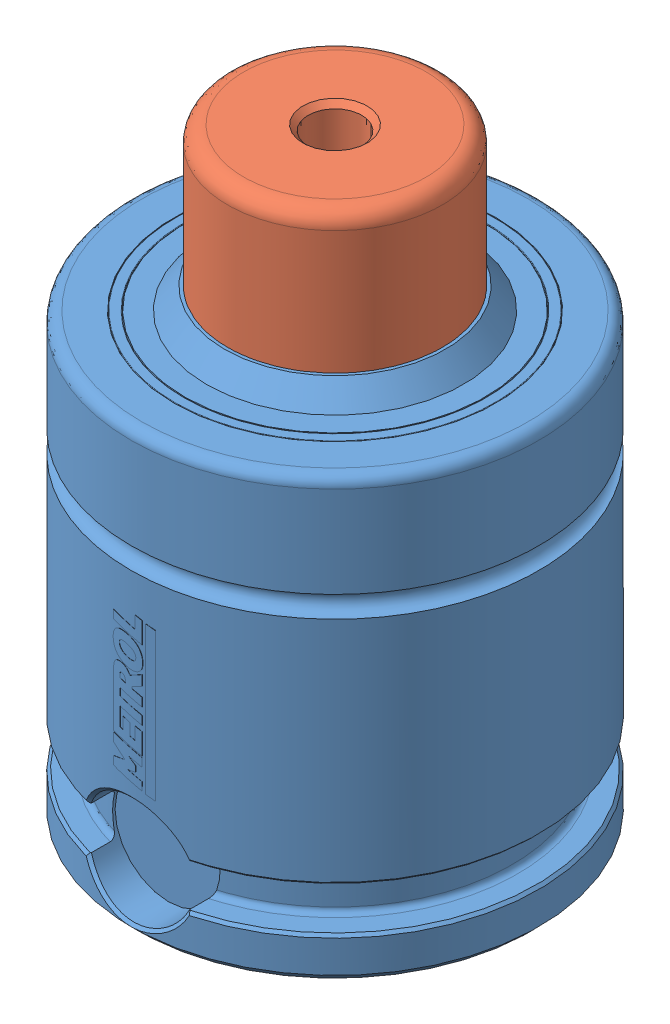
SolidWorks assembly EX0500-013.SLDASM, configuration Default (file format 7000). Lengths in mm.
Overall size (41.69 56 41.69).
2 component instances, 2 part files, 5 mates.
Components (placement in the parent):
- EX0500 Body-1: EX0500 Body.SLDPRT [EX-500-013] x (0 0 1) z (0 -1 0) size (38.1 38 43)
- EX-500 Piston-1: EX-500 Piston.SLDPRT [EX-500-013] at (0 26 0) x (0.82631 0 -0.563216) z (0 -1 0) size (30 30 30)
Mates (geometry in assembly coordinates):
- Concentric1: concentric aligned: cylinder of EX0500 Body-1 through (0 0 0) axis (0 -1 0) radius 10; cylinder of EX-500 Piston-1 through (0 26 0) axis (0 -1 0) radius 10
- LimitDistance1: limit distance anti-aligned: plane of EX-500 Piston-1 through (8.4482 31 12.3946) normal (0 1 0); plane of EX0500 Body-1 through (0 31 0) normal (0 -1 0)
- Coincident1: coincident anti-aligned: plane of EX0500 Body-1 through (0 0 0) normal (0 -1 0); plane of assembly through (0 0 0) normal (0 1 0)
- Coincident2: coincident aligned: plane of EX0500 Body-1; plane of assembly through (0 0 0) normal (0 0 1)
- Coincident3: coincident anti-aligned: plane of EX0500 Body-1; plane of assembly through (0 0 0) normal (1 0 0)
